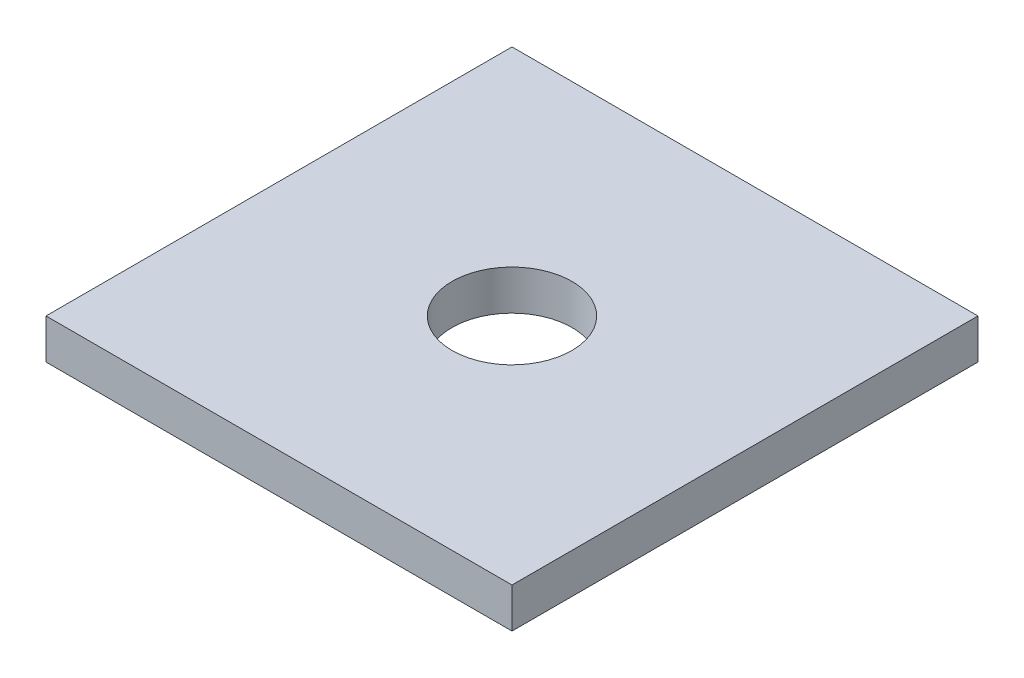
from build123d import *

# Parameters (mm, degrees)
SKETCH1_W      = 35
SKETCH1_H      = 35
SKETCH1_R      = 4.5
EXTRUDE1_DEPTH = 3


with BuildPart() as part:
    # Sketch1 → Extrude1 (new body)
    with BuildSketch(Plane(origin=(0, 0, 0), x_dir=(1, 0, 0), z_dir=(0, 1, 0))):
        with Locations((17.5, 17.5)):
            Rectangle(SKETCH1_W, SKETCH1_H)
        with Locations(Location((17.5, 17.5, 0), (0, 0, 270))):
            Circle(SKETCH1_R, mode=Mode.SUBTRACT)
    extrude(amount=EXTRUDE1_DEPTH)


solid = part.part
